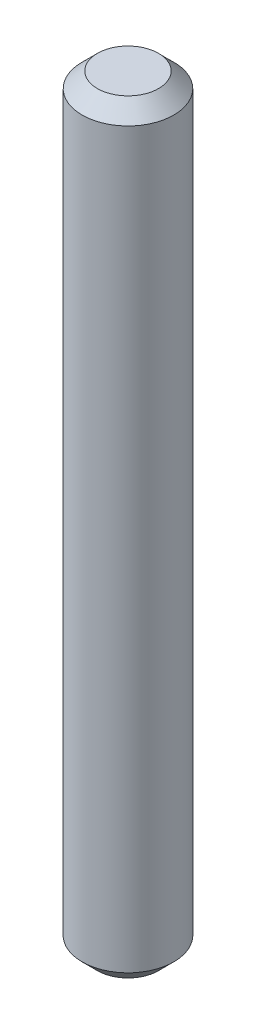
from build123d import *

# Parameters (mm, degrees)
ESQUISSE1_R      = 3
EXTRUSION1_DEPTH = 50
CHANFREIN1_SIZE  = 1


with BuildPart() as part:
    # Esquisse1 → Extrusion1 (new body)
    with BuildSketch(Plane(origin=(0, 0, 0), x_dir=(1, 0, 0), z_dir=(0, 1, 0))):
        with Locations(Location((0, 0, 0), (0, 0, 270))):
            Circle(ESQUISSE1_R)
    extrude(amount=EXTRUSION1_DEPTH)

    # Chanfrein1
    chanfrein1_edges = [part.edges().sort_by_distance(p)[0] for p in [
        (0, 0, -3),
        (0, 50, -3),
    ]]
    chamfer(chanfrein1_edges, length=CHANFREIN1_SIZE)


solid = part.part
